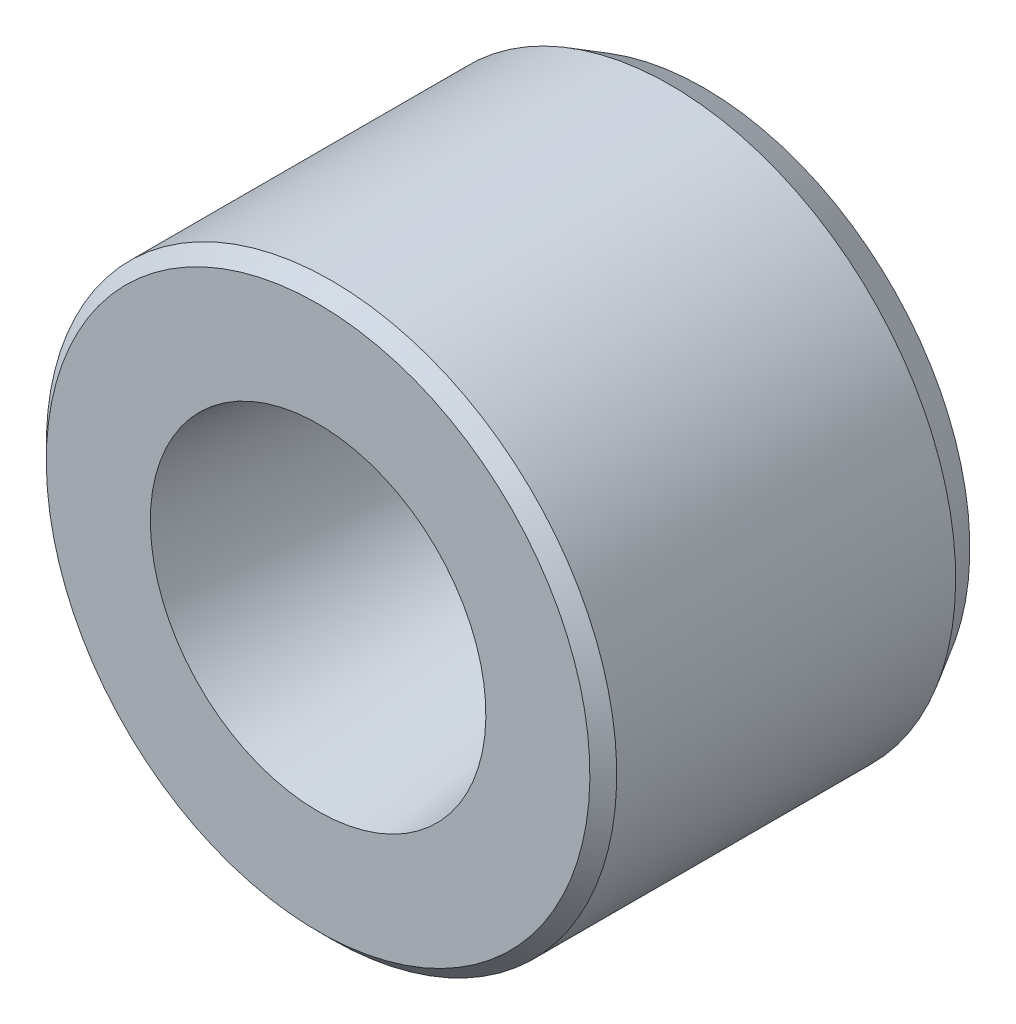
ISO-10303-21;
HEADER;
FILE_DESCRIPTION(('STEP AP214'),'2;1');
FILE_NAME('part.step','',(''),(''),'','','');
FILE_SCHEMA(('AUTOMOTIVE_DESIGN { 1 0 10303 214 1 1 1 1 }'));
ENDSEC;
DATA;
#1=APPLICATION_CONTEXT('core data for automotive mechanical design processes');
#2=APPLICATION_PROTOCOL_DEFINITION('international standard','automotive_design',2000,#1);
#3=PRODUCT_CONTEXT('',#1,'mechanical');
#4=PRODUCT('Part','Part','',(#3));
#5=PRODUCT_RELATED_PRODUCT_CATEGORY('part','',(#4));
#6=PRODUCT_DEFINITION_FORMATION('','',#4);
#7=PRODUCT_DEFINITION_CONTEXT('part definition',#1,'design');
#8=PRODUCT_DEFINITION('design','',#6,#7);
#9=PRODUCT_DEFINITION_SHAPE('','',#8);
#10=(LENGTH_UNIT() NAMED_UNIT(*) SI_UNIT(.MILLI.,.METRE.));
#11=(NAMED_UNIT(*) PLANE_ANGLE_UNIT() SI_UNIT($,.RADIAN.));
#12=(NAMED_UNIT(*) SI_UNIT($,.STERADIAN.) SOLID_ANGLE_UNIT());
#13=UNCERTAINTY_MEASURE_WITH_UNIT(LENGTH_MEASURE(1.E-05),#10,'distance_accuracy_value','');
#14=(GEOMETRIC_REPRESENTATION_CONTEXT(3) GLOBAL_UNCERTAINTY_ASSIGNED_CONTEXT((#13)) GLOBAL_UNIT_ASSIGNED_CONTEXT((#10,
#11,#12)) REPRESENTATION_CONTEXT('',''));
#15=CARTESIAN_POINT('',(0.,0.,0.));
#16=DIRECTION('',(0.,0.,1.));
#17=DIRECTION('',(1.,0.,0.));
#18=AXIS2_PLACEMENT_3D('',#15,#16,#17);
#19=CARTESIAN_POINT('',(0.,0.,-1.01408464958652E-10));
#20=DIRECTION('',(0.,0.,1.));
#21=DIRECTION('',(0.,-1.,0.));
#22=AXIS2_PLACEMENT_3D('',#19,#20,#21);
#23=CONICAL_SURFACE('',#22,4.99999999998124,0.130899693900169);
#24=CARTESIAN_POINT('',(0.,0.,1.22783727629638E-11));
#25=DIRECTION('',(0.,0.,1.));
#26=DIRECTION('',(0.,-1.,0.));
#27=AXIS2_PLACEMENT_3D('',#24,#25,#26);
#28=CIRCLE('',#27,4.99999999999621);
#29=CARTESIAN_POINT('',(0.,-4.99999999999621,1.22783727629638E-11));
#30=VERTEX_POINT('',#29);
#31=EDGE_CURVE('E15',#30,#30,#28,.F.);
#32=ORIENTED_EDGE('',*,*,#31,.F.);
#33=EDGE_LOOP('',(#32));
#34=FACE_BOUND('',#33,.T.);
#35=CARTESIAN_POINT('',(0.,0.,-11.5));
#36=DIRECTION('',(0.,0.,1.));
#37=DIRECTION('',(0.,-1.,0.));
#38=AXIS2_PLACEMENT_3D('',#35,#36,#37);
#39=CIRCLE('',#38,3.48599627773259);
#40=CARTESIAN_POINT('',(0.,-3.48599627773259,-11.5));
#41=VERTEX_POINT('',#40);
#42=EDGE_CURVE('E35',#41,#41,#39,.T.);
#43=ORIENTED_EDGE('',*,*,#42,.F.);
#44=EDGE_LOOP('',(#43));
#45=FACE_BOUND('',#44,.T.);
#46=ADVANCED_FACE('F12',(#34,#45),#23,.F.);
#47=CARTESIAN_POINT('',(8.1,0.,0.));
#48=DIRECTION('',(0.,0.,1.));
#49=DIRECTION('',(0.,-1.,0.));
#50=AXIS2_PLACEMENT_3D('',#47,#48,#49);
#51=PLANE('',#50);
#52=CARTESIAN_POINT('',(0.,0.,0.));
#53=DIRECTION('',(0.,0.,-1.));
#54=DIRECTION('',(0.,1.,0.));
#55=AXIS2_PLACEMENT_3D('',#52,#53,#54);
#56=CIRCLE('',#55,8.1);
#57=CARTESIAN_POINT('',(0.,8.1,0.));
#58=VERTEX_POINT('',#57);
#59=EDGE_CURVE('E33',#58,#58,#56,.T.);
#60=ORIENTED_EDGE('',*,*,#59,.F.);
#61=EDGE_LOOP('',(#60));
#62=FACE_BOUND('',#61,.T.);
#63=ORIENTED_EDGE('',*,*,#31,.T.);
#64=EDGE_LOOP('',(#63));
#65=FACE_BOUND('',#64,.T.);
#66=ADVANCED_FACE('F42',(#62,#65),#51,.T.);
#67=CARTESIAN_POINT('',(3.48599627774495,0.,-11.5));
#68=DIRECTION('',(0.,0.,-1.));
#69=DIRECTION('',(0.,1.,0.));
#70=AXIS2_PLACEMENT_3D('',#67,#68,#69);
#71=PLANE('',#70);
#72=ORIENTED_EDGE('',*,*,#42,.T.);
#73=EDGE_LOOP('',(#72));
#74=FACE_BOUND('',#73,.T.);
#75=CARTESIAN_POINT('',(0.,0.,-11.5));
#76=DIRECTION('',(0.,0.,1.));
#77=DIRECTION('',(0.,-1.,0.));
#78=AXIS2_PLACEMENT_3D('',#75,#76,#77);
#79=CIRCLE('',#78,7.92264973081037);
#80=CARTESIAN_POINT('',(0.,-7.92264973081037,-11.5));
#81=VERTEX_POINT('',#80);
#82=EDGE_CURVE('E24',#81,#81,#79,.T.);
#83=ORIENTED_EDGE('',*,*,#82,.F.);
#84=EDGE_LOOP('',(#83));
#85=FACE_BOUND('',#84,.T.);
#86=ADVANCED_FACE('F50',(#74,#85),#71,.T.);
#87=CARTESIAN_POINT('',(0.,0.,-0.4));
#88=DIRECTION('',(0.,0.,-1.));
#89=DIRECTION('',(0.,1.,0.));
#90=AXIS2_PLACEMENT_3D('',#87,#88,#89);
#91=CONICAL_SURFACE('',#90,8.5,0.785398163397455);
#92=CARTESIAN_POINT('',(0.,0.,-0.4));
#93=DIRECTION('',(0.,0.,1.));
#94=DIRECTION('',(0.,-1.,0.));
#95=AXIS2_PLACEMENT_3D('',#92,#93,#94);
#96=CIRCLE('',#95,8.5);
#97=CARTESIAN_POINT('',(0.,-8.5,-0.4));
#98=VERTEX_POINT('',#97);
#99=EDGE_CURVE('E19',#98,#98,#96,.F.);
#100=ORIENTED_EDGE('',*,*,#99,.F.);
#101=EDGE_LOOP('',(#100));
#102=FACE_BOUND('',#101,.T.);
#103=ORIENTED_EDGE('',*,*,#59,.T.);
#104=EDGE_LOOP('',(#103));
#105=FACE_BOUND('',#104,.T.);
#106=ADVANCED_FACE('F59',(#102,#105),#91,.T.);
#107=CARTESIAN_POINT('',(0.,0.,-10.5));
#108=DIRECTION('',(0.,0.,1.));
#109=DIRECTION('',(0.,-1.,0.));
#110=AXIS2_PLACEMENT_3D('',#107,#108,#109);
#111=CONICAL_SURFACE('',#110,8.5,0.523598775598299);
#112=ORIENTED_EDGE('',*,*,#82,.T.);
#113=EDGE_LOOP('',(#112));
#114=FACE_BOUND('',#113,.T.);
#115=CARTESIAN_POINT('',(0.,0.,-10.5));
#116=DIRECTION('',(0.,0.,1.));
#117=DIRECTION('',(0.,-1.,0.));
#118=AXIS2_PLACEMENT_3D('',#115,#116,#117);
#119=CIRCLE('',#118,8.5);
#120=CARTESIAN_POINT('',(0.,-8.5,-10.5));
#121=VERTEX_POINT('',#120);
#122=EDGE_CURVE('E8',#121,#121,#119,.T.);
#123=ORIENTED_EDGE('',*,*,#122,.F.);
#124=EDGE_LOOP('',(#123));
#125=FACE_BOUND('',#124,.T.);
#126=ADVANCED_FACE('F54',(#114,#125),#111,.T.);
#127=CARTESIAN_POINT('',(0.,0.,-11.5));
#128=DIRECTION('',(0.,0.,1.));
#129=DIRECTION('',(0.,-1.,0.));
#130=AXIS2_PLACEMENT_3D('',#127,#128,#129);
#131=CYLINDRICAL_SURFACE('',#130,8.5);
#132=ORIENTED_EDGE('',*,*,#122,.T.);
#133=EDGE_LOOP('',(#132));
#134=FACE_BOUND('',#133,.T.);
#135=ORIENTED_EDGE('',*,*,#99,.T.);
#136=EDGE_LOOP('',(#135));
#137=FACE_BOUND('',#136,.T.);
#138=ADVANCED_FACE('F52',(#134,#137),#131,.T.);
#139=CLOSED_SHELL('',(#46,#66,#86,#106,#126,#138));
#140=MANIFOLD_SOLID_BREP('B1',#139);
#141=ADVANCED_BREP_SHAPE_REPRESENTATION('',(#18,#140),#14);
#142=SHAPE_DEFINITION_REPRESENTATION(#9,#141);
ENDSEC;
END-ISO-10303-21;
